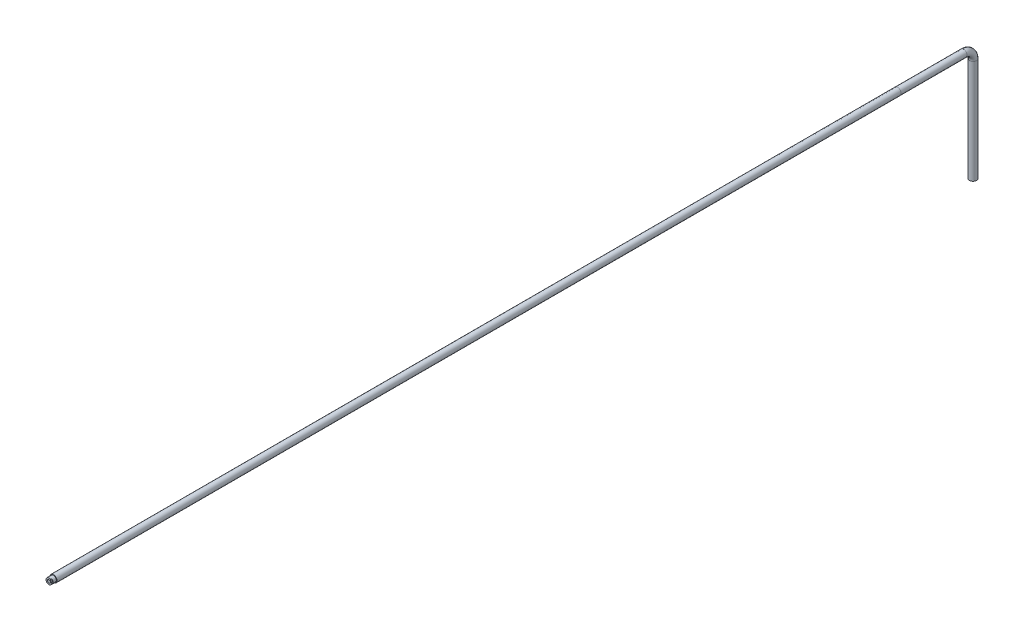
ISO-10303-21;
HEADER;
FILE_DESCRIPTION(('STEP AP214'),'2;1');
FILE_NAME('part.step','',(''),(''),'','','');
FILE_SCHEMA(('AUTOMOTIVE_DESIGN { 1 0 10303 214 1 1 1 1 }'));
ENDSEC;
DATA;
#1=APPLICATION_CONTEXT('core data for automotive mechanical design processes');
#2=APPLICATION_PROTOCOL_DEFINITION('international standard','automotive_design',2000,#1);
#3=PRODUCT_CONTEXT('',#1,'mechanical');
#4=PRODUCT('Part','Part','',(#3));
#5=PRODUCT_RELATED_PRODUCT_CATEGORY('part','',(#4));
#6=PRODUCT_DEFINITION_FORMATION('','',#4);
#7=PRODUCT_DEFINITION_CONTEXT('part definition',#1,'design');
#8=PRODUCT_DEFINITION('design','',#6,#7);
#9=PRODUCT_DEFINITION_SHAPE('','',#8);
#10=(LENGTH_UNIT() NAMED_UNIT(*) SI_UNIT(.MILLI.,.METRE.));
#11=(NAMED_UNIT(*) PLANE_ANGLE_UNIT() SI_UNIT($,.RADIAN.));
#12=(NAMED_UNIT(*) SI_UNIT($,.STERADIAN.) SOLID_ANGLE_UNIT());
#13=UNCERTAINTY_MEASURE_WITH_UNIT(LENGTH_MEASURE(1.E-05),#10,'distance_accuracy_value','');
#14=(GEOMETRIC_REPRESENTATION_CONTEXT(3) GLOBAL_UNCERTAINTY_ASSIGNED_CONTEXT((#13)) GLOBAL_UNIT_ASSIGNED_CONTEXT((#10,
#11,#12)) REPRESENTATION_CONTEXT('',''));
#15=CARTESIAN_POINT('',(0.,0.,0.));
#16=DIRECTION('',(0.,0.,1.));
#17=DIRECTION('',(1.,0.,0.));
#18=AXIS2_PLACEMENT_3D('',#15,#16,#17);
#19=CARTESIAN_POINT('',(0.,0.,-615.95));
#20=DIRECTION('',(0.,0.,1.));
#21=DIRECTION('',(1.,0.,0.));
#22=AXIS2_PLACEMENT_3D('',#19,#20,#21);
#23=CYLINDRICAL_SURFACE('',#22,2.38125);
#24=CARTESIAN_POINT('',(0.,0.,-571.5));
#25=DIRECTION('',(0.,0.,1.));
#26=DIRECTION('',(1.,0.,0.));
#27=AXIS2_PLACEMENT_3D('',#24,#25,#26);
#28=CIRCLE('',#27,2.38125);
#29=CARTESIAN_POINT('',(2.38125,0.,-571.5));
#30=VERTEX_POINT('',#29);
#31=EDGE_CURVE('E63',#30,#30,#28,.F.);
#32=ORIENTED_EDGE('',*,*,#31,.F.);
#33=EDGE_LOOP('',(#32));
#34=FACE_BOUND('',#33,.T.);
#35=CARTESIAN_POINT('',(0.,0.,-3.04800000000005));
#36=DIRECTION('',(0.,0.,1.));
#37=DIRECTION('',(1.,0.,0.));
#38=AXIS2_PLACEMENT_3D('',#35,#36,#37);
#39=CIRCLE('',#38,2.38125);
#40=CARTESIAN_POINT('',(2.38125,0.,-3.04800000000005));
#41=VERTEX_POINT('',#40);
#42=EDGE_CURVE('E106',#41,#41,#39,.F.);
#43=ORIENTED_EDGE('',*,*,#42,.T.);
#44=EDGE_LOOP('',(#43));
#45=FACE_BOUND('',#44,.T.);
#46=ADVANCED_FACE('F59',(#34,#45),#23,.T.);
#47=CARTESIAN_POINT('',(0.,-36.909375,-3.048));
#48=DIRECTION('',(0.,0.,1.));
#49=DIRECTION('',(1.,0.,0.));
#50=AXIS2_PLACEMENT_3D('',#47,#48,#49);
#51=PLANE('',#50);
#52=ORIENTED_EDGE('',*,*,#42,.F.);
#53=EDGE_LOOP('',(#52));
#54=FACE_BOUND('',#53,.T.);
#55=CARTESIAN_POINT('',(0.,0.,-3.048));
#56=DIRECTION('',(0.,0.,1.));
#57=DIRECTION('',(1.,0.,0.));
#58=AXIS2_PLACEMENT_3D('',#55,#56,#57);
#59=CIRCLE('',#58,1.9685);
#60=CARTESIAN_POINT('',(1.9685,0.,-3.048));
#61=VERTEX_POINT('',#60);
#62=EDGE_CURVE('E103',#61,#61,#59,.T.);
#63=ORIENTED_EDGE('',*,*,#62,.F.);
#64=EDGE_LOOP('',(#63));
#65=FACE_BOUND('',#64,.T.);
#66=ADVANCED_FACE('F124',(#54,#65),#51,.T.);
#67=CARTESIAN_POINT('',(0.,0.,-3.048));
#68=DIRECTION('',(0.,0.,1.));
#69=DIRECTION('',(1.,0.,0.));
#70=AXIS2_PLACEMENT_3D('',#67,#68,#69);
#71=CYLINDRICAL_SURFACE('',#70,1.9685);
#72=DIRECTION('',(0.,0.,1.));
#73=VECTOR('',#72,1.);
#74=CARTESIAN_POINT('',(1.91755505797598,-0.444943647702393,-3.048));
#75=LINE('',#74,#73);
#76=CARTESIAN_POINT('',(1.91755505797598,-0.444943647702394,0.));
#77=VERTEX_POINT('',#76);
#78=CARTESIAN_POINT('',(1.91755505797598,-0.444943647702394,-0.79248));
#79=VERTEX_POINT('',#78);
#80=EDGE_CURVE('E88',#77,#79,#75,.F.);
#81=ORIENTED_EDGE('',*,*,#80,.F.);
#82=CARTESIAN_POINT('',(0.,0.,0.));
#83=DIRECTION('',(0.,0.,1.));
#84=DIRECTION('',(1.,0.,0.));
#85=AXIS2_PLACEMENT_3D('',#82,#83,#84);
#86=CIRCLE('',#85,1.9685);
#87=CARTESIAN_POINT('',(1.00470953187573,1.69279384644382,0.));
#88=VERTEX_POINT('',#87);
#89=EDGE_CURVE('E99',#88,#77,#86,.T.);
#90=ORIENTED_EDGE('',*,*,#89,.F.);
#91=DIRECTION('',(0.,0.,1.));
#92=VECTOR('',#91,1.);
#93=CARTESIAN_POINT('',(1.00470953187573,1.69279384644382,-3.048));
#94=LINE('',#93,#92);
#95=CARTESIAN_POINT('',(1.00470953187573,1.69279384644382,-0.79248));
#96=VERTEX_POINT('',#95);
#97=EDGE_CURVE('E75',#96,#88,#94,.T.);
#98=ORIENTED_EDGE('',*,*,#97,.F.);
#99=CARTESIAN_POINT('',(0.,0.,-0.79248));
#100=DIRECTION('',(0.,0.,-1.));
#101=DIRECTION('',(-1.,0.,0.));
#102=AXIS2_PLACEMENT_3D('',#99,#100,#101);
#103=CIRCLE('',#102,1.9685);
#104=EDGE_CURVE('E13',#79,#96,#103,.F.);
#105=ORIENTED_EDGE('',*,*,#104,.F.);
#106=EDGE_LOOP('',(#81,#90,#98,#105));
#107=FACE_BOUND('',#106,.T.);
#108=ORIENTED_EDGE('',*,*,#62,.T.);
#109=EDGE_LOOP('',(#108));
#110=FACE_BOUND('',#109,.T.);
#111=ADVANCED_FACE('F97',(#107,#110),#71,.T.);
#112=CARTESIAN_POINT('',(0.,0.,-7.6708));
#113=DIRECTION('',(0.,0.,1.));
#114=DIRECTION('',(1.,0.,0.));
#115=AXIS2_PLACEMENT_3D('',#112,#113,#114);
#116=CONICAL_SURFACE('',#115,0.996949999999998,1.02974425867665);
#117=CARTESIAN_POINT('',(0.,0.,-8.26982799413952));
#118=VERTEX_POINT('',#117);
#119=VERTEX_LOOP('',#118);
#120=FACE_BOUND('',#119,.T.);
#121=CARTESIAN_POINT('',(0.,0.,-7.6708));
#122=DIRECTION('',(0.,0.,1.));
#123=DIRECTION('',(1.,0.,0.));
#124=AXIS2_PLACEMENT_3D('',#121,#122,#123);
#125=CIRCLE('',#124,0.996949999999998);
#126=CARTESIAN_POINT('',(0.996949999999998,0.,-7.6708));
#127=VERTEX_POINT('',#126);
#128=EDGE_CURVE('E112',#127,#127,#125,.T.);
#129=ORIENTED_EDGE('',*,*,#128,.T.);
#130=EDGE_LOOP('',(#129));
#131=FACE_BOUND('',#130,.T.);
#132=ADVANCED_FACE('F130',(#120,#131),#116,.F.);
#133=CARTESIAN_POINT('',(0.,0.,0.));
#134=DIRECTION('',(0.,0.,1.));
#135=DIRECTION('',(1.,0.,0.));
#136=AXIS2_PLACEMENT_3D('',#133,#134,#135);
#137=CYLINDRICAL_SURFACE('',#136,0.996949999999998);
#138=ORIENTED_EDGE('',*,*,#128,.F.);
#139=EDGE_LOOP('',(#138));
#140=FACE_BOUND('',#139,.T.);
#141=CARTESIAN_POINT('',(0.,0.,0.));
#142=DIRECTION('',(0.,0.,1.));
#143=DIRECTION('',(1.,0.,0.));
#144=AXIS2_PLACEMENT_3D('',#141,#142,#143);
#145=CIRCLE('',#144,0.996949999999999);
#146=CARTESIAN_POINT('',(0.996949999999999,0.,0.));
#147=VERTEX_POINT('',#146);
#148=EDGE_CURVE('E109',#147,#147,#145,.T.);
#149=ORIENTED_EDGE('',*,*,#148,.T.);
#150=EDGE_LOOP('',(#149));
#151=FACE_BOUND('',#150,.T.);
#152=ADVANCED_FACE('F135',(#140,#151),#137,.F.);
#153=CARTESIAN_POINT('',(0.,0.,0.));
#154=DIRECTION('',(0.,0.,1.));
#155=DIRECTION('',(1.,0.,0.));
#156=AXIS2_PLACEMENT_3D('',#153,#154,#155);
#157=PLANE('',#156);
#158=DIRECTION('',(0.39270951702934,-0.919662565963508,0.));
#159=VECTOR('',#158,1.);
#160=CARTESIAN_POINT('',(1.46113229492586,0.62392509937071,0.));
#161=LINE('',#160,#159);
#162=EDGE_CURVE('E68',#88,#77,#161,.T.);
#163=ORIENTED_EDGE('',*,*,#162,.F.);
#164=ORIENTED_EDGE('',*,*,#89,.T.);
#165=EDGE_LOOP('',(#163,#164));
#166=FACE_BOUND('',#165,.T.);
#167=ORIENTED_EDGE('',*,*,#148,.F.);
#168=EDGE_LOOP('',(#167));
#169=FACE_BOUND('',#168,.T.);
#170=ADVANCED_FACE('F101',(#166,#169),#157,.T.);
#171=CARTESIAN_POINT('',(0.430891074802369,3.03658443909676,-0.79248));
#172=DIRECTION('',(-0.919662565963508,-0.39270951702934,0.));
#173=DIRECTION('',(0.39270951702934,-0.919662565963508,0.));
#174=AXIS2_PLACEMENT_3D('',#171,#172,#173);
#175=PLANE('',#174);
#176=ORIENTED_EDGE('',*,*,#80,.T.);
#177=DIRECTION('',(0.39270951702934,-0.919662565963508,0.));
#178=VECTOR('',#177,1.);
#179=CARTESIAN_POINT('',(0.430891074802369,3.03658443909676,-0.79248));
#180=LINE('',#179,#178);
#181=EDGE_CURVE('E204',#96,#79,#180,.T.);
#182=ORIENTED_EDGE('',*,*,#181,.F.);
#183=ORIENTED_EDGE('',*,*,#97,.T.);
#184=ORIENTED_EDGE('',*,*,#162,.T.);
#185=EDGE_LOOP('',(#176,#182,#183,#184));
#186=FACE_BOUND('',#185,.T.);
#187=ADVANCED_FACE('F87',(#186),#175,.F.);
#188=CARTESIAN_POINT('',(3.99783993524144,1.85609852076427,-0.79248));
#189=DIRECTION('',(0.,0.,-1.));
#190=DIRECTION('',(-1.,0.,0.));
#191=AXIS2_PLACEMENT_3D('',#188,#189,#190);
#192=PLANE('',#191);
#193=ORIENTED_EDGE('',*,*,#104,.T.);
#194=ORIENTED_EDGE('',*,*,#181,.T.);
#195=EDGE_LOOP('',(#193,#194));
#196=FACE_BOUND('',#195,.T.);
#197=ADVANCED_FACE('F183',(#196),#192,.F.);
#198=CARTESIAN_POINT('',(0.,-36.909375,-615.95));
#199=DIRECTION('',(0.,0.,1.));
#200=DIRECTION('',(1.,0.,0.));
#201=AXIS2_PLACEMENT_3D('',#198,#199,#200);
#202=PLANE('',#201);
#203=CARTESIAN_POINT('',(0.,0.,-615.95));
#204=DIRECTION('',(0.,0.,1.));
#205=DIRECTION('',(1.,0.,0.));
#206=AXIS2_PLACEMENT_3D('',#203,#204,#205);
#207=CIRCLE('',#206,2.3495);
#208=CARTESIAN_POINT('',(2.3495,0.,-615.95));
#209=VERTEX_POINT('',#208);
#210=EDGE_CURVE('E201',#209,#209,#207,.T.);
#211=ORIENTED_EDGE('',*,*,#210,.F.);
#212=EDGE_LOOP('',(#211));
#213=FACE_BOUND('',#212,.T.);
#214=CARTESIAN_POINT('',(0.,0.,-615.95));
#215=DIRECTION('',(0.,0.,1.));
#216=DIRECTION('',(1.,0.,0.));
#217=AXIS2_PLACEMENT_3D('',#214,#215,#216);
#218=CIRCLE('',#217,2.38125);
#219=CARTESIAN_POINT('',(0.,2.38125,-615.95));
#220=VERTEX_POINT('',#219);
#221=EDGE_CURVE('E157',#220,#220,#218,.T.);
#222=ORIENTED_EDGE('',*,*,#221,.T.);
#223=EDGE_LOOP('',(#222));
#224=FACE_BOUND('',#223,.T.);
#225=ADVANCED_FACE('F187',(#213,#224),#202,.T.);
#226=CARTESIAN_POINT('',(0.,-36.909375,-571.5));
#227=DIRECTION('',(0.,0.,1.));
#228=DIRECTION('',(1.,0.,0.));
#229=AXIS2_PLACEMENT_3D('',#226,#227,#228);
#230=PLANE('',#229);
#231=ORIENTED_EDGE('',*,*,#31,.T.);
#232=EDGE_LOOP('',(#231));
#233=FACE_BOUND('',#232,.T.);
#234=CARTESIAN_POINT('',(0.,0.,-571.5));
#235=DIRECTION('',(0.,0.,1.));
#236=DIRECTION('',(1.,0.,0.));
#237=AXIS2_PLACEMENT_3D('',#234,#235,#236);
#238=CIRCLE('',#237,2.3495);
#239=CARTESIAN_POINT('',(2.3495,0.,-571.5));
#240=VERTEX_POINT('',#239);
#241=EDGE_CURVE('E205',#240,#240,#238,.T.);
#242=ORIENTED_EDGE('',*,*,#241,.T.);
#243=EDGE_LOOP('',(#242));
#244=FACE_BOUND('',#243,.T.);
#245=ADVANCED_FACE('F167',(#233,#244),#230,.F.);
#246=CARTESIAN_POINT('',(0.,0.,-615.95));
#247=DIRECTION('',(0.,0.,1.));
#248=DIRECTION('',(1.,0.,0.));
#249=AXIS2_PLACEMENT_3D('',#246,#247,#248);
#250=CYLINDRICAL_SURFACE('',#249,2.3495);
#251=ORIENTED_EDGE('',*,*,#210,.T.);
#252=EDGE_LOOP('',(#251));
#253=FACE_BOUND('',#252,.T.);
#254=ORIENTED_EDGE('',*,*,#241,.F.);
#255=EDGE_LOOP('',(#254));
#256=FACE_BOUND('',#255,.T.);
#257=ADVANCED_FACE('F163',(#253,#256),#250,.T.);
#258=CARTESIAN_POINT('',(0.,-76.2,-622.3));
#259=DIRECTION('',(0.,1.,0.));
#260=DIRECTION('',(1.,0.,0.));
#261=AXIS2_PLACEMENT_3D('',#258,#259,#260);
#262=PLANE('',#261);
#263=CARTESIAN_POINT('',(0.,-76.2,-622.3));
#264=DIRECTION('',(0.,1.,0.));
#265=DIRECTION('',(1.,0.,0.));
#266=AXIS2_PLACEMENT_3D('',#263,#264,#265);
#267=CIRCLE('',#266,2.38125);
#268=CARTESIAN_POINT('',(2.38125,-76.2,-622.3));
#269=VERTEX_POINT('',#268);
#270=EDGE_CURVE('E93',#269,#269,#267,.T.);
#271=ORIENTED_EDGE('',*,*,#270,.F.);
#272=EDGE_LOOP('',(#271));
#273=FACE_BOUND('',#272,.T.);
#274=ADVANCED_FACE('F152',(#273),#262,.F.);
#275=CARTESIAN_POINT('',(0.,-6.34999999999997,-622.299999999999));
#276=DIRECTION('',(0.,-1.,0.));
#277=DIRECTION('',(0.,0.,-1.));
#278=AXIS2_PLACEMENT_3D('',#275,#276,#277);
#279=CYLINDRICAL_SURFACE('',#278,2.38125);
#280=CARTESIAN_POINT('',(0.,-6.34999999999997,-622.299999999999));
#281=DIRECTION('',(0.,1.,0.));
#282=DIRECTION('',(1.,0.,0.));
#283=AXIS2_PLACEMENT_3D('',#280,#281,#282);
#284=CIRCLE('',#283,2.38125);
#285=CARTESIAN_POINT('',(0.,-6.34999999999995,-624.68125));
#286=VERTEX_POINT('',#285);
#287=EDGE_CURVE('E115',#286,#286,#284,.T.);
#288=ORIENTED_EDGE('',*,*,#287,.F.);
#289=EDGE_LOOP('',(#288));
#290=FACE_BOUND('',#289,.T.);
#291=ORIENTED_EDGE('',*,*,#270,.T.);
#292=EDGE_LOOP('',(#291));
#293=FACE_BOUND('',#292,.T.);
#294=ADVANCED_FACE('F61',(#290,#293),#279,.T.);
#295=CARTESIAN_POINT('',(0.,-6.35,-615.95));
#296=DIRECTION('',(-1.,0.,0.));
#297=DIRECTION('',(0.,0.,1.));
#298=AXIS2_PLACEMENT_3D('',#295,#296,#297);
#299=TOROIDAL_SURFACE('',#298,6.35,2.38125);
#300=CARTESIAN_POINT('',(0.,-6.35,-615.95));
#301=DIRECTION('',(-1.,0.,0.));
#302=DIRECTION('',(0.,0.,1.));
#303=AXIS2_PLACEMENT_3D('',#300,#301,#302);
#304=CIRCLE('',#303,8.73125);
#305=EDGE_CURVE('',#220,#286,#304,.T.);
#306=ORIENTED_EDGE('',*,*,#221,.F.);
#307=ORIENTED_EDGE('',*,*,#287,.T.);
#308=ORIENTED_EDGE('',*,*,#305,.T.);
#309=ORIENTED_EDGE('',*,*,#305,.F.);
#310=EDGE_LOOP('',(#306,#308,#307,#309));
#311=FACE_BOUND('',#310,.T.);
#312=ADVANCED_FACE('F146',(#311),#299,.T.);
#313=CLOSED_SHELL('',(#46,#66,#111,#132,#152,#170,#187,#197,#225,#245,#257,#274,#294,#312));
#314=MANIFOLD_SOLID_BREP('B2',#313);
#315=ADVANCED_BREP_SHAPE_REPRESENTATION('',(#18,#314),#14);
#316=SHAPE_DEFINITION_REPRESENTATION(#9,#315);
ENDSEC;
END-ISO-10303-21;
